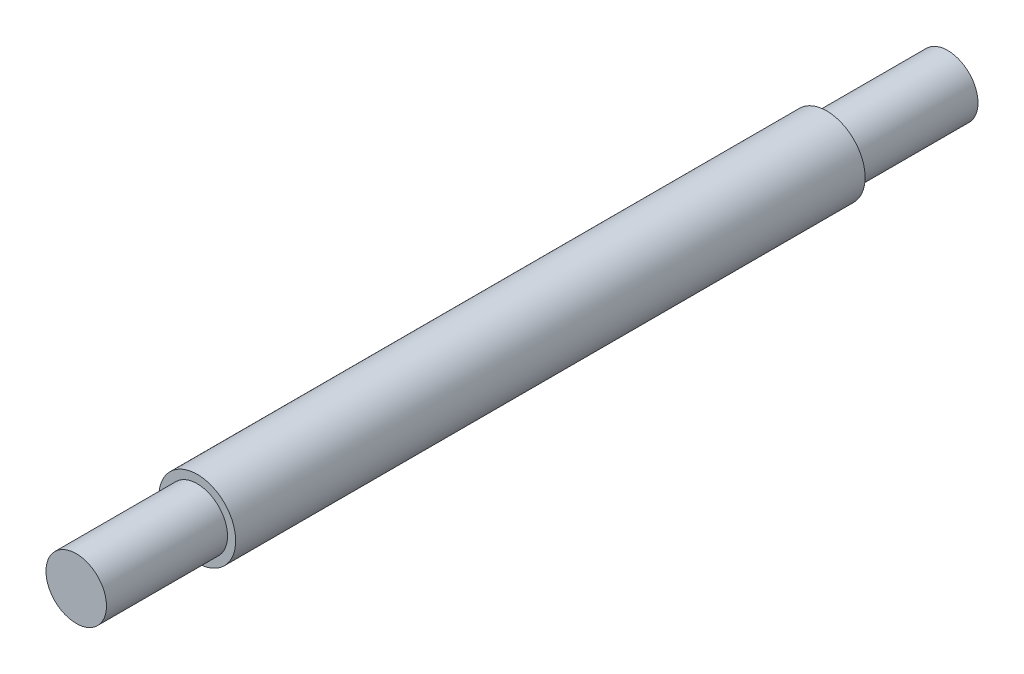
ISO-10303-21;
HEADER;
FILE_DESCRIPTION(('STEP AP214'),'2;1');
FILE_NAME('part.step','',(''),(''),'','','');
FILE_SCHEMA(('AUTOMOTIVE_DESIGN { 1 0 10303 214 1 1 1 1 }'));
ENDSEC;
DATA;
#1=APPLICATION_CONTEXT('core data for automotive mechanical design processes');
#2=APPLICATION_PROTOCOL_DEFINITION('international standard','automotive_design',2000,#1);
#3=PRODUCT_CONTEXT('',#1,'mechanical');
#4=PRODUCT('Part','Part','',(#3));
#5=PRODUCT_RELATED_PRODUCT_CATEGORY('part','',(#4));
#6=PRODUCT_DEFINITION_FORMATION('','',#4);
#7=PRODUCT_DEFINITION_CONTEXT('part definition',#1,'design');
#8=PRODUCT_DEFINITION('design','',#6,#7);
#9=PRODUCT_DEFINITION_SHAPE('','',#8);
#10=(LENGTH_UNIT() NAMED_UNIT(*) SI_UNIT(.MILLI.,.METRE.));
#11=(NAMED_UNIT(*) PLANE_ANGLE_UNIT() SI_UNIT($,.RADIAN.));
#12=(NAMED_UNIT(*) SI_UNIT($,.STERADIAN.) SOLID_ANGLE_UNIT());
#13=UNCERTAINTY_MEASURE_WITH_UNIT(LENGTH_MEASURE(1.E-05),#10,'distance_accuracy_value','');
#14=(GEOMETRIC_REPRESENTATION_CONTEXT(3) GLOBAL_UNCERTAINTY_ASSIGNED_CONTEXT((#13)) GLOBAL_UNIT_ASSIGNED_CONTEXT((#10,
#11,#12)) REPRESENTATION_CONTEXT('',''));
#15=CARTESIAN_POINT('',(0.,0.,0.));
#16=DIRECTION('',(0.,0.,1.));
#17=DIRECTION('',(1.,0.,0.));
#18=AXIS2_PLACEMENT_3D('',#15,#16,#17);
#19=CARTESIAN_POINT('',(0.,0.,10.));
#20=DIRECTION('',(0.,0.,-1.));
#21=DIRECTION('',(-1.,0.,0.));
#22=AXIS2_PLACEMENT_3D('',#19,#20,#21);
#23=CYLINDRICAL_SURFACE('',#22,2.5);
#24=CARTESIAN_POINT('',(0.,0.,10.));
#25=DIRECTION('',(0.,0.,1.));
#26=DIRECTION('',(1.,0.,0.));
#27=AXIS2_PLACEMENT_3D('',#24,#25,#26);
#28=CIRCLE('',#27,2.5);
#29=CARTESIAN_POINT('',(2.5,0.,10.));
#30=VERTEX_POINT('',#29);
#31=EDGE_CURVE('E51',#30,#30,#28,.T.);
#32=ORIENTED_EDGE('',*,*,#31,.F.);
#33=EDGE_LOOP('',(#32));
#34=FACE_BOUND('',#33,.T.);
#35=CARTESIAN_POINT('',(0.,0.,0.));
#36=DIRECTION('',(0.,0.,1.));
#37=DIRECTION('',(1.,0.,0.));
#38=AXIS2_PLACEMENT_3D('',#35,#36,#37);
#39=CIRCLE('',#38,2.5);
#40=CARTESIAN_POINT('',(2.5,0.,0.));
#41=VERTEX_POINT('',#40);
#42=EDGE_CURVE('E46',#41,#41,#39,.T.);
#43=ORIENTED_EDGE('',*,*,#42,.T.);
#44=EDGE_LOOP('',(#43));
#45=FACE_BOUND('',#44,.T.);
#46=ADVANCED_FACE('F43',(#34,#45),#23,.T.);
#47=CARTESIAN_POINT('',(0.,0.,0.));
#48=DIRECTION('',(0.,0.,1.));
#49=DIRECTION('',(1.,0.,0.));
#50=AXIS2_PLACEMENT_3D('',#47,#48,#49);
#51=PLANE('',#50);
#52=ORIENTED_EDGE('',*,*,#42,.F.);
#53=EDGE_LOOP('',(#52));
#54=FACE_BOUND('',#53,.T.);
#55=ADVANCED_FACE('F89',(#54),#51,.F.);
#56=CARTESIAN_POINT('',(0.,0.,62.));
#57=DIRECTION('',(0.,0.,-1.));
#58=DIRECTION('',(-1.,0.,0.));
#59=AXIS2_PLACEMENT_3D('',#56,#57,#58);
#60=CYLINDRICAL_SURFACE('',#59,3.175);
#61=CARTESIAN_POINT('',(0.,0.,62.));
#62=DIRECTION('',(0.,0.,1.));
#63=DIRECTION('',(1.,0.,0.));
#64=AXIS2_PLACEMENT_3D('',#61,#62,#63);
#65=CIRCLE('',#64,3.175);
#66=CARTESIAN_POINT('',(-3.175,0.,62.));
#67=VERTEX_POINT('',#66);
#68=EDGE_CURVE('E60',#67,#67,#65,.T.);
#69=CARTESIAN_POINT('',(0.,0.,10.));
#70=DIRECTION('',(0.,0.,1.));
#71=DIRECTION('',(1.,0.,0.));
#72=AXIS2_PLACEMENT_3D('',#69,#70,#71);
#73=CIRCLE('',#72,3.175);
#74=CARTESIAN_POINT('',(-3.175,0.,10.));
#75=VERTEX_POINT('',#74);
#76=EDGE_CURVE('E64',#75,#75,#73,.T.);
#77=CARTESIAN_POINT('',(-3.175,0.,62.));
#78=CARTESIAN_POINT('',(-3.175,0.,61.4583333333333));
#79=CARTESIAN_POINT('',(-3.175,0.,60.9166666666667));
#80=CARTESIAN_POINT('',(-3.175,0.,59.8333333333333));
#81=CARTESIAN_POINT('',(-3.175,0.,59.2916666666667));
#82=CARTESIAN_POINT('',(-3.175,0.,58.2083333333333));
#83=CARTESIAN_POINT('',(-3.175,0.,57.6666666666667));
#84=CARTESIAN_POINT('',(-3.175,0.,56.5833333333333));
#85=CARTESIAN_POINT('',(-3.175,0.,56.0416666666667));
#86=CARTESIAN_POINT('',(-3.175,0.,54.9583333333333));
#87=CARTESIAN_POINT('',(-3.175,0.,54.4166666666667));
#88=CARTESIAN_POINT('',(-3.175,0.,53.3333333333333));
#89=CARTESIAN_POINT('',(-3.175,0.,52.7916666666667));
#90=CARTESIAN_POINT('',(-3.175,0.,51.7083333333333));
#91=CARTESIAN_POINT('',(-3.175,0.,51.1666666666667));
#92=CARTESIAN_POINT('',(-3.175,0.,50.0833333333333));
#93=CARTESIAN_POINT('',(-3.175,0.,49.5416666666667));
#94=CARTESIAN_POINT('',(-3.175,0.,48.4583333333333));
#95=CARTESIAN_POINT('',(-3.175,0.,47.9166666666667));
#96=CARTESIAN_POINT('',(-3.175,0.,46.8333333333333));
#97=CARTESIAN_POINT('',(-3.175,0.,46.2916666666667));
#98=CARTESIAN_POINT('',(-3.175,0.,45.2083333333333));
#99=CARTESIAN_POINT('',(-3.175,0.,44.6666666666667));
#100=CARTESIAN_POINT('',(-3.175,0.,43.5833333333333));
#101=CARTESIAN_POINT('',(-3.175,0.,43.0416666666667));
#102=CARTESIAN_POINT('',(-3.175,0.,41.9583333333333));
#103=CARTESIAN_POINT('',(-3.175,0.,41.4166666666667));
#104=CARTESIAN_POINT('',(-3.175,0.,40.3333333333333));
#105=CARTESIAN_POINT('',(-3.175,0.,39.7916666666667));
#106=CARTESIAN_POINT('',(-3.175,0.,38.7083333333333));
#107=CARTESIAN_POINT('',(-3.175,0.,38.1666666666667));
#108=CARTESIAN_POINT('',(-3.175,0.,37.0833333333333));
#109=CARTESIAN_POINT('',(-3.175,0.,36.5416666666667));
#110=CARTESIAN_POINT('',(-3.175,0.,35.4583333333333));
#111=CARTESIAN_POINT('',(-3.175,0.,34.9166666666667));
#112=CARTESIAN_POINT('',(-3.175,0.,33.8333333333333));
#113=CARTESIAN_POINT('',(-3.175,0.,33.2916666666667));
#114=CARTESIAN_POINT('',(-3.175,0.,32.2083333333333));
#115=CARTESIAN_POINT('',(-3.175,0.,31.6666666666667));
#116=CARTESIAN_POINT('',(-3.175,0.,30.5833333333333));
#117=CARTESIAN_POINT('',(-3.175,0.,30.0416666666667));
#118=CARTESIAN_POINT('',(-3.175,0.,28.9583333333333));
#119=CARTESIAN_POINT('',(-3.175,0.,28.4166666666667));
#120=CARTESIAN_POINT('',(-3.175,0.,27.3333333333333));
#121=CARTESIAN_POINT('',(-3.175,0.,26.7916666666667));
#122=CARTESIAN_POINT('',(-3.175,0.,25.7083333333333));
#123=CARTESIAN_POINT('',(-3.175,0.,25.1666666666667));
#124=CARTESIAN_POINT('',(-3.175,0.,24.0833333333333));
#125=CARTESIAN_POINT('',(-3.175,0.,23.5416666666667));
#126=CARTESIAN_POINT('',(-3.175,0.,22.4583333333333));
#127=CARTESIAN_POINT('',(-3.175,0.,21.9166666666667));
#128=CARTESIAN_POINT('',(-3.175,0.,20.8333333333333));
#129=CARTESIAN_POINT('',(-3.175,0.,20.2916666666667));
#130=CARTESIAN_POINT('',(-3.175,0.,19.2083333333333));
#131=CARTESIAN_POINT('',(-3.175,0.,18.6666666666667));
#132=CARTESIAN_POINT('',(-3.175,0.,17.5833333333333));
#133=CARTESIAN_POINT('',(-3.175,0.,17.0416666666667));
#134=CARTESIAN_POINT('',(-3.175,0.,15.9583333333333));
#135=CARTESIAN_POINT('',(-3.175,0.,15.4166666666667));
#136=CARTESIAN_POINT('',(-3.175,0.,14.3333333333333));
#137=CARTESIAN_POINT('',(-3.175,0.,13.7916666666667));
#138=CARTESIAN_POINT('',(-3.175,0.,12.7083333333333));
#139=CARTESIAN_POINT('',(-3.175,0.,12.1666666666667));
#140=CARTESIAN_POINT('',(-3.175,0.,11.0833333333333));
#141=CARTESIAN_POINT('',(-3.175,0.,10.5416666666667));
#142=CARTESIAN_POINT('',(-3.175,0.,10.));
#143=B_SPLINE_CURVE_WITH_KNOTS('',3,(#77,#78,#79,#80,#81,#82,#83,#84,#85,#86,#87,#88,#89,#90,
#91,#92,#93,#94,#95,#96,#97,#98,#99,#100,#101,#102,#103,#104,#105,#106,#107,#108,#109,#110,#111,
#112,#113,#114,#115,#116,#117,#118,#119,#120,#121,#122,#123,#124,#125,#126,#127,#128,#129,#130,
#131,#132,#133,#134,#135,#136,#137,#138,#139,#140,#141,#142),.UNSPECIFIED.,.F.,.F.,(4,2,2,2,2,2,
2,2,2,2,2,2,2,2,2,2,2,2,2,2,2,2,2,2,2,2,2,2,2,2,2,2,4),(0.,1.62499999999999,3.25,4.875,6.5,
8.12499999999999,9.74999999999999,11.375,13.,14.625,16.25,17.875,19.5,21.125,22.75,24.375,26.,
27.625,29.25,30.875,32.5,34.125,35.75,37.375,39.,40.625,42.25,43.875,45.5,47.125,48.75,50.375,
52.),.UNSPECIFIED.);
#144=EDGE_CURVE('BSEAM94',#67,#75,#143,.T.);
#145=ORIENTED_EDGE('',*,*,#68,.F.);
#146=ORIENTED_EDGE('',*,*,#76,.T.);
#147=ORIENTED_EDGE('',*,*,#144,.T.);
#148=ORIENTED_EDGE('',*,*,#144,.F.);
#149=EDGE_LOOP('',(#145,#147,#146,#148));
#150=FACE_BOUND('',#149,.T.);
#151=ADVANCED_FACE('F94',(#150),#60,.T.);
#152=CARTESIAN_POINT('',(0.,0.,62.));
#153=DIRECTION('',(0.,0.,1.));
#154=DIRECTION('',(1.,0.,0.));
#155=AXIS2_PLACEMENT_3D('',#152,#153,#154);
#156=PLANE('',#155);
#157=CARTESIAN_POINT('',(0.,0.,62.));
#158=DIRECTION('',(0.,0.,1.));
#159=DIRECTION('',(1.,0.,0.));
#160=AXIS2_PLACEMENT_3D('',#157,#158,#159);
#161=CIRCLE('',#160,2.5);
#162=CARTESIAN_POINT('',(2.5,0.,62.));
#163=VERTEX_POINT('',#162);
#164=EDGE_CURVE('E10',#163,#163,#161,.T.);
#165=ORIENTED_EDGE('',*,*,#164,.F.);
#166=EDGE_LOOP('',(#165));
#167=FACE_BOUND('',#166,.T.);
#168=ORIENTED_EDGE('',*,*,#68,.T.);
#169=EDGE_LOOP('',(#168));
#170=FACE_BOUND('',#169,.T.);
#171=ADVANCED_FACE('F84',(#167,#170),#156,.T.);
#172=CARTESIAN_POINT('',(0.,0.,10.));
#173=DIRECTION('',(0.,0.,1.));
#174=DIRECTION('',(1.,0.,0.));
#175=AXIS2_PLACEMENT_3D('',#172,#173,#174);
#176=PLANE('',#175);
#177=ORIENTED_EDGE('',*,*,#31,.T.);
#178=EDGE_LOOP('',(#177));
#179=FACE_BOUND('',#178,.T.);
#180=ORIENTED_EDGE('',*,*,#76,.F.);
#181=EDGE_LOOP('',(#180));
#182=FACE_BOUND('',#181,.T.);
#183=ADVANCED_FACE('F77',(#179,#182),#176,.F.);
#184=CARTESIAN_POINT('',(0.,0.,72.));
#185=DIRECTION('',(0.,0.,-1.));
#186=DIRECTION('',(-1.,0.,0.));
#187=AXIS2_PLACEMENT_3D('',#184,#185,#186);
#188=CYLINDRICAL_SURFACE('',#187,2.5);
#189=CARTESIAN_POINT('',(0.,0.,72.));
#190=DIRECTION('',(0.,0.,1.));
#191=DIRECTION('',(1.,0.,0.));
#192=AXIS2_PLACEMENT_3D('',#189,#190,#191);
#193=CIRCLE('',#192,2.5);
#194=CARTESIAN_POINT('',(2.5,0.,72.));
#195=VERTEX_POINT('',#194);
#196=EDGE_CURVE('E59',#195,#195,#193,.T.);
#197=ORIENTED_EDGE('',*,*,#196,.F.);
#198=EDGE_LOOP('',(#197));
#199=FACE_BOUND('',#198,.T.);
#200=ORIENTED_EDGE('',*,*,#164,.T.);
#201=EDGE_LOOP('',(#200));
#202=FACE_BOUND('',#201,.T.);
#203=ADVANCED_FACE('F75',(#199,#202),#188,.T.);
#204=CARTESIAN_POINT('',(0.,0.,72.));
#205=DIRECTION('',(0.,0.,1.));
#206=DIRECTION('',(1.,0.,0.));
#207=AXIS2_PLACEMENT_3D('',#204,#205,#206);
#208=PLANE('',#207);
#209=ORIENTED_EDGE('',*,*,#196,.T.);
#210=EDGE_LOOP('',(#209));
#211=FACE_BOUND('',#210,.T.);
#212=ADVANCED_FACE('F73',(#211),#208,.T.);
#213=CLOSED_SHELL('',(#46,#55,#151,#171,#183,#203,#212));
#214=MANIFOLD_SOLID_BREP('B2',#213);
#215=ADVANCED_BREP_SHAPE_REPRESENTATION('',(#18,#214),#14);
#216=SHAPE_DEFINITION_REPRESENTATION(#9,#215);
ENDSEC;
END-ISO-10303-21;
